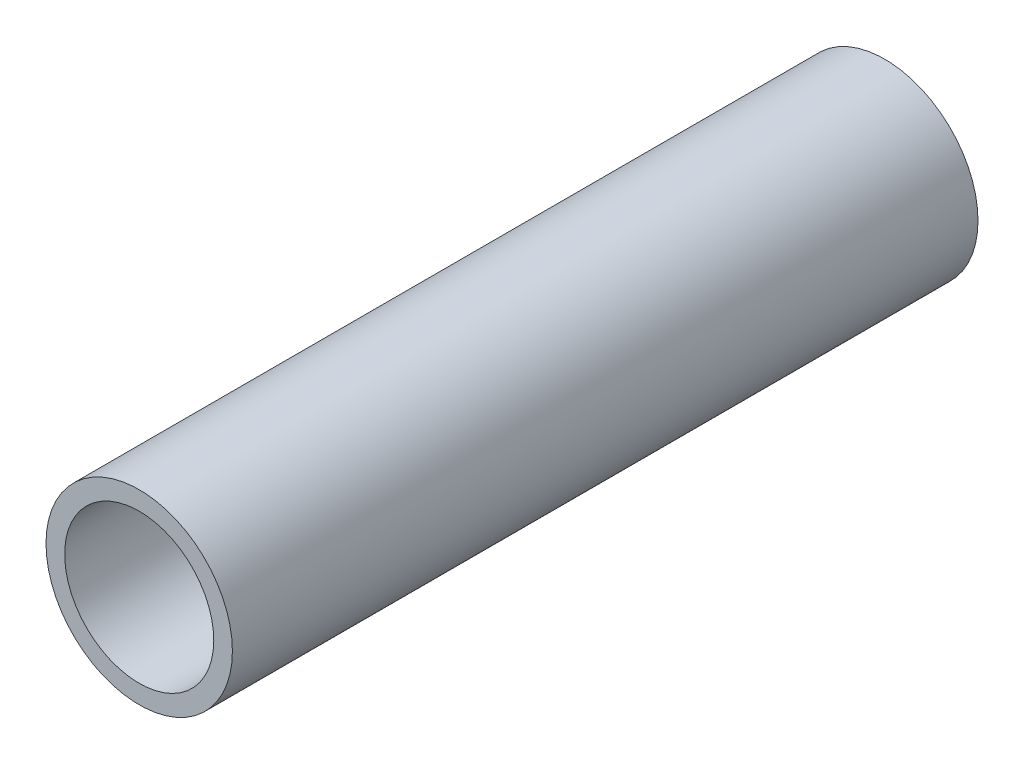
ISO-10303-21;
HEADER;
FILE_DESCRIPTION(('STEP AP214'),'2;1');
FILE_NAME('part.step','',(''),(''),'','','');
FILE_SCHEMA(('AUTOMOTIVE_DESIGN { 1 0 10303 214 1 1 1 1 }'));
ENDSEC;
DATA;
#1=APPLICATION_CONTEXT('core data for automotive mechanical design processes');
#2=APPLICATION_PROTOCOL_DEFINITION('international standard','automotive_design',2000,#1);
#3=PRODUCT_CONTEXT('',#1,'mechanical');
#4=PRODUCT('Part','Part','',(#3));
#5=PRODUCT_RELATED_PRODUCT_CATEGORY('part','',(#4));
#6=PRODUCT_DEFINITION_FORMATION('','',#4);
#7=PRODUCT_DEFINITION_CONTEXT('part definition',#1,'design');
#8=PRODUCT_DEFINITION('design','',#6,#7);
#9=PRODUCT_DEFINITION_SHAPE('','',#8);
#10=(LENGTH_UNIT() NAMED_UNIT(*) SI_UNIT(.MILLI.,.METRE.));
#11=(NAMED_UNIT(*) PLANE_ANGLE_UNIT() SI_UNIT($,.RADIAN.));
#12=(NAMED_UNIT(*) SI_UNIT($,.STERADIAN.) SOLID_ANGLE_UNIT());
#13=UNCERTAINTY_MEASURE_WITH_UNIT(LENGTH_MEASURE(1.E-05),#10,'distance_accuracy_value','');
#14=(GEOMETRIC_REPRESENTATION_CONTEXT(3) GLOBAL_UNCERTAINTY_ASSIGNED_CONTEXT((#13)) GLOBAL_UNIT_ASSIGNED_CONTEXT((#10,
#11,#12)) REPRESENTATION_CONTEXT('',''));
#15=CARTESIAN_POINT('',(0.,0.,0.));
#16=DIRECTION('',(0.,0.,1.));
#17=DIRECTION('',(1.,0.,0.));
#18=AXIS2_PLACEMENT_3D('',#15,#16,#17);
#19=CARTESIAN_POINT('',(0.,0.,100.));
#20=DIRECTION('',(0.,0.,1.));
#21=DIRECTION('',(1.,0.,0.));
#22=AXIS2_PLACEMENT_3D('',#19,#20,#21);
#23=PLANE('',#22);
#24=CARTESIAN_POINT('',(0.,0.,100.));
#25=DIRECTION('',(0.,0.,1.));
#26=DIRECTION('',(1.,0.,0.));
#27=AXIS2_PLACEMENT_3D('',#24,#25,#26);
#28=CIRCLE('',#27,12.5);
#29=CARTESIAN_POINT('',(12.5,0.,100.));
#30=VERTEX_POINT('',#29);
#31=EDGE_CURVE('E10',#30,#30,#28,.T.);
#32=ORIENTED_EDGE('',*,*,#31,.T.);
#33=EDGE_LOOP('',(#32));
#34=FACE_BOUND('',#33,.T.);
#35=CARTESIAN_POINT('',(0.,0.,100.));
#36=DIRECTION('',(0.,0.,1.));
#37=DIRECTION('',(1.,0.,0.));
#38=AXIS2_PLACEMENT_3D('',#35,#36,#37);
#39=CIRCLE('',#38,10.);
#40=CARTESIAN_POINT('',(10.,0.,100.));
#41=VERTEX_POINT('',#40);
#42=EDGE_CURVE('E40',#41,#41,#39,.T.);
#43=ORIENTED_EDGE('',*,*,#42,.F.);
#44=EDGE_LOOP('',(#43));
#45=FACE_BOUND('',#44,.T.);
#46=ADVANCED_FACE('F29',(#34,#45),#23,.T.);
#47=CARTESIAN_POINT('',(0.,0.,0.));
#48=DIRECTION('',(0.,0.,1.));
#49=DIRECTION('',(1.,0.,0.));
#50=AXIS2_PLACEMENT_3D('',#47,#48,#49);
#51=PLANE('',#50);
#52=CARTESIAN_POINT('',(0.,0.,0.));
#53=DIRECTION('',(0.,0.,1.));
#54=DIRECTION('',(1.,0.,0.));
#55=AXIS2_PLACEMENT_3D('',#52,#53,#54);
#56=CIRCLE('',#55,12.5);
#57=CARTESIAN_POINT('',(12.5,0.,0.));
#58=VERTEX_POINT('',#57);
#59=EDGE_CURVE('E36',#58,#58,#56,.T.);
#60=ORIENTED_EDGE('',*,*,#59,.F.);
#61=EDGE_LOOP('',(#60));
#62=FACE_BOUND('',#61,.T.);
#63=CARTESIAN_POINT('',(0.,0.,0.));
#64=DIRECTION('',(0.,0.,1.));
#65=DIRECTION('',(1.,0.,0.));
#66=AXIS2_PLACEMENT_3D('',#63,#64,#65);
#67=CIRCLE('',#66,10.);
#68=CARTESIAN_POINT('',(10.,0.,0.));
#69=VERTEX_POINT('',#68);
#70=EDGE_CURVE('E44',#69,#69,#67,.T.);
#71=ORIENTED_EDGE('',*,*,#70,.T.);
#72=EDGE_LOOP('',(#71));
#73=FACE_BOUND('',#72,.T.);
#74=ADVANCED_FACE('F50',(#62,#73),#51,.F.);
#75=CARTESIAN_POINT('',(0.,0.,100.));
#76=DIRECTION('',(0.,0.,-1.));
#77=DIRECTION('',(-1.,0.,0.));
#78=AXIS2_PLACEMENT_3D('',#75,#76,#77);
#79=CYLINDRICAL_SURFACE('',#78,12.5);
#80=ORIENTED_EDGE('',*,*,#31,.F.);
#81=EDGE_LOOP('',(#80));
#82=FACE_BOUND('',#81,.T.);
#83=ORIENTED_EDGE('',*,*,#59,.T.);
#84=EDGE_LOOP('',(#83));
#85=FACE_BOUND('',#84,.T.);
#86=ADVANCED_FACE('F31',(#82,#85),#79,.T.);
#87=CARTESIAN_POINT('',(0.,0.,100.));
#88=DIRECTION('',(0.,0.,-1.));
#89=DIRECTION('',(-1.,0.,0.));
#90=AXIS2_PLACEMENT_3D('',#87,#88,#89);
#91=CYLINDRICAL_SURFACE('',#90,10.);
#92=ORIENTED_EDGE('',*,*,#42,.T.);
#93=EDGE_LOOP('',(#92));
#94=FACE_BOUND('',#93,.T.);
#95=ORIENTED_EDGE('',*,*,#70,.F.);
#96=EDGE_LOOP('',(#95));
#97=FACE_BOUND('',#96,.T.);
#98=ADVANCED_FACE('F52',(#94,#97),#91,.F.);
#99=CLOSED_SHELL('',(#46,#74,#86,#98));
#100=MANIFOLD_SOLID_BREP('B2',#99);
#101=ADVANCED_BREP_SHAPE_REPRESENTATION('',(#18,#100),#14);
#102=SHAPE_DEFINITION_REPRESENTATION(#9,#101);
ENDSEC;
END-ISO-10303-21;
